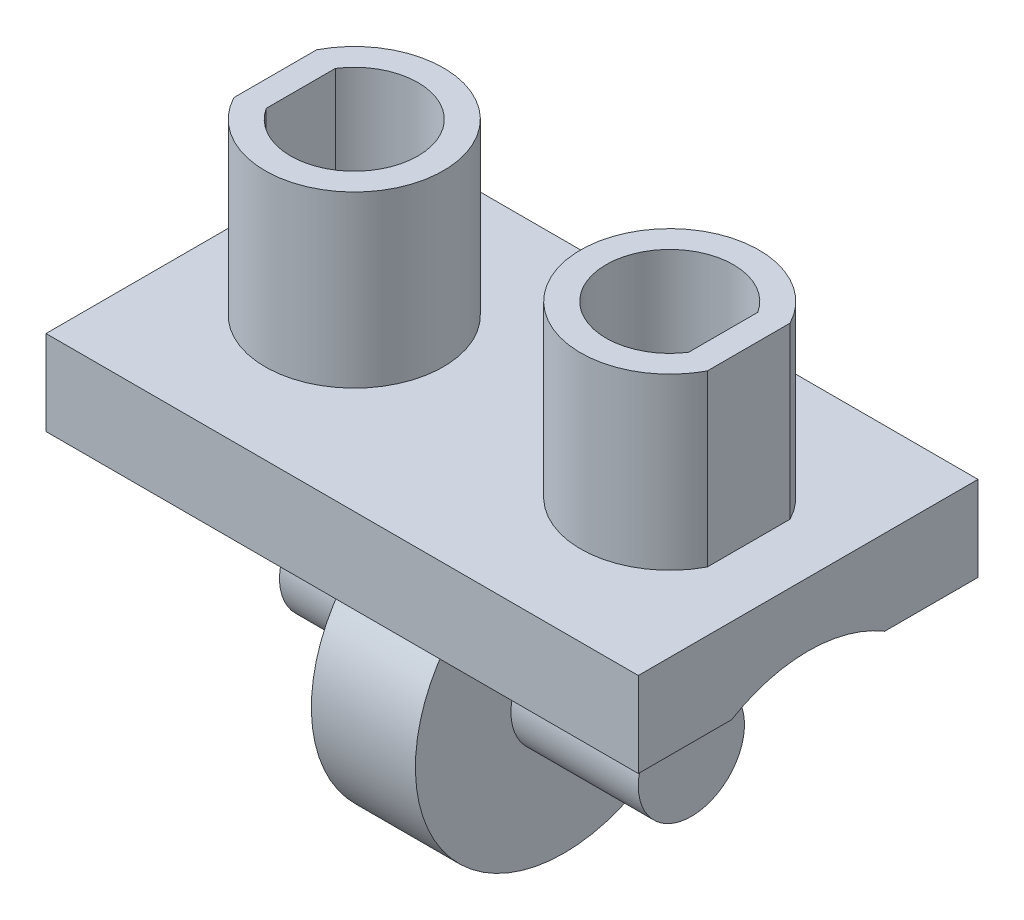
ISO-10303-21;
HEADER;
FILE_DESCRIPTION(('STEP AP214'),'2;1');
FILE_NAME('part.step','',(''),(''),'','','');
FILE_SCHEMA(('AUTOMOTIVE_DESIGN { 1 0 10303 214 1 1 1 1 }'));
ENDSEC;
DATA;
#1=APPLICATION_CONTEXT('core data for automotive mechanical design processes');
#2=APPLICATION_PROTOCOL_DEFINITION('international standard','automotive_design',2000,#1);
#3=PRODUCT_CONTEXT('',#1,'mechanical');
#4=PRODUCT('Part','Part','',(#3));
#5=PRODUCT_RELATED_PRODUCT_CATEGORY('part','',(#4));
#6=PRODUCT_DEFINITION_FORMATION('','',#4);
#7=PRODUCT_DEFINITION_CONTEXT('part definition',#1,'design');
#8=PRODUCT_DEFINITION('design','',#6,#7);
#9=PRODUCT_DEFINITION_SHAPE('','',#8);
#10=(LENGTH_UNIT() NAMED_UNIT(*) SI_UNIT(.MILLI.,.METRE.));
#11=(NAMED_UNIT(*) PLANE_ANGLE_UNIT() SI_UNIT($,.RADIAN.));
#12=(NAMED_UNIT(*) SI_UNIT($,.STERADIAN.) SOLID_ANGLE_UNIT());
#13=UNCERTAINTY_MEASURE_WITH_UNIT(LENGTH_MEASURE(1.E-05),#10,'distance_accuracy_value','');
#14=(GEOMETRIC_REPRESENTATION_CONTEXT(3) GLOBAL_UNCERTAINTY_ASSIGNED_CONTEXT((#13)) GLOBAL_UNIT_ASSIGNED_CONTEXT((#10,
#11,#12)) REPRESENTATION_CONTEXT('',''));
#15=CARTESIAN_POINT('',(0.,0.,0.));
#16=DIRECTION('',(0.,0.,1.));
#17=DIRECTION('',(1.,0.,0.));
#18=AXIS2_PLACEMENT_3D('',#15,#16,#17);
#19=CARTESIAN_POINT('',(10.975,16.,-4.5));
#20=DIRECTION('',(0.,1.,0.));
#21=DIRECTION('',(1.,0.,0.));
#22=AXIS2_PLACEMENT_3D('',#19,#20,#21);
#23=PLANE('',#22);
#24=CARTESIAN_POINT('',(7.71504933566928,16.,-0.5));
#25=DIRECTION('',(0.,1.,0.));
#26=DIRECTION('',(0.,0.,-1.));
#27=AXIS2_PLACEMENT_3D('',#24,#25,#26);
#28=CIRCLE('',#27,1.5);
#29=CARTESIAN_POINT('',(8.975,16.,-1.31395597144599));
#30=VERTEX_POINT('',#29);
#31=CARTESIAN_POINT('',(8.975,16.,0.313955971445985));
#32=VERTEX_POINT('',#31);
#33=EDGE_CURVE('E249',#30,#32,#28,.T.);
#34=ORIENTED_EDGE('',*,*,#33,.T.);
#35=DIRECTION('',(0.,0.,-1.));
#36=VECTOR('',#35,1.);
#37=CARTESIAN_POINT('',(8.975,16.,-1.31395597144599));
#38=LINE('',#37,#36);
#39=EDGE_CURVE('E11',#32,#30,#38,.T.);
#40=ORIENTED_EDGE('',*,*,#39,.T.);
#41=EDGE_LOOP('',(#34,#40));
#42=FACE_BOUND('',#41,.T.);
#43=ADVANCED_FACE('F17',(#42),#23,.T.);
#44=CARTESIAN_POINT('',(8.975,20.,-1.31395597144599));
#45=DIRECTION('',(-1.,0.,0.));
#46=DIRECTION('',(0.,0.,1.));
#47=AXIS2_PLACEMENT_3D('',#44,#45,#46);
#48=PLANE('',#47);
#49=ORIENTED_EDGE('',*,*,#39,.F.);
#50=DIRECTION('',(0.,-1.,0.));
#51=VECTOR('',#50,1.);
#52=CARTESIAN_POINT('',(8.975,20.,0.313955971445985));
#53=LINE('',#52,#51);
#54=CARTESIAN_POINT('',(8.975,20.,0.313955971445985));
#55=VERTEX_POINT('',#54);
#56=EDGE_CURVE('E254',#55,#32,#53,.T.);
#57=ORIENTED_EDGE('',*,*,#56,.F.);
#58=DIRECTION('',(0.,0.,-1.));
#59=VECTOR('',#58,1.);
#60=CARTESIAN_POINT('',(8.975,20.,-1.31395597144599));
#61=LINE('',#60,#59);
#62=CARTESIAN_POINT('',(8.975,20.,-1.31395597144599));
#63=VERTEX_POINT('',#62);
#64=EDGE_CURVE('E28',#55,#63,#61,.T.);
#65=ORIENTED_EDGE('',*,*,#64,.T.);
#66=DIRECTION('',(0.,-1.,0.));
#67=VECTOR('',#66,1.);
#68=CARTESIAN_POINT('',(8.975,20.,-1.31395597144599));
#69=LINE('',#68,#67);
#70=EDGE_CURVE('E253',#63,#30,#69,.T.);
#71=ORIENTED_EDGE('',*,*,#70,.T.);
#72=EDGE_LOOP('',(#49,#57,#65,#71));
#73=FACE_BOUND('',#72,.T.);
#74=ADVANCED_FACE('F455',(#73),#48,.T.);
#75=CARTESIAN_POINT('',(9.575,20.,-1.47497873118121));
#76=DIRECTION('',(-1.,0.,0.));
#77=DIRECTION('',(0.,1.,0.));
#78=AXIS2_PLACEMENT_3D('',#75,#76,#77);
#79=PLANE('',#78);
#80=DIRECTION('',(0.,0.,-1.));
#81=VECTOR('',#80,1.);
#82=CARTESIAN_POINT('',(9.575,16.,-1.47497873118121));
#83=LINE('',#82,#81);
#84=CARTESIAN_POINT('',(9.575,16.,0.4749787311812));
#85=VERTEX_POINT('',#84);
#86=CARTESIAN_POINT('',(9.575,16.,-1.47497873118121));
#87=VERTEX_POINT('',#86);
#88=EDGE_CURVE('E190',#85,#87,#83,.T.);
#89=ORIENTED_EDGE('',*,*,#88,.T.);
#90=DIRECTION('',(0.,-1.,0.));
#91=VECTOR('',#90,1.);
#92=CARTESIAN_POINT('',(9.575,20.,-1.47497873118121));
#93=LINE('',#92,#91);
#94=CARTESIAN_POINT('',(9.575,20.,-1.47497873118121));
#95=VERTEX_POINT('',#94);
#96=EDGE_CURVE('E350',#95,#87,#93,.T.);
#97=ORIENTED_EDGE('',*,*,#96,.F.);
#98=DIRECTION('',(0.,0.,-1.));
#99=VECTOR('',#98,1.);
#100=CARTESIAN_POINT('',(9.575,20.,-1.47497873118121));
#101=LINE('',#100,#99);
#102=CARTESIAN_POINT('',(9.575,20.,0.4749787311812));
#103=VERTEX_POINT('',#102);
#104=EDGE_CURVE('E338',#103,#95,#101,.T.);
#105=ORIENTED_EDGE('',*,*,#104,.F.);
#106=DIRECTION('',(0.,-1.,0.));
#107=VECTOR('',#106,1.);
#108=CARTESIAN_POINT('',(9.575,20.,0.4749787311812));
#109=LINE('',#108,#107);
#110=EDGE_CURVE('E225',#103,#85,#109,.T.);
#111=ORIENTED_EDGE('',*,*,#110,.T.);
#112=EDGE_LOOP('',(#89,#97,#105,#111));
#113=FACE_BOUND('',#112,.T.);
#114=ADVANCED_FACE('F461',(#113),#79,.F.);
#115=CARTESIAN_POINT('',(7.71504933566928,20.,-0.5));
#116=DIRECTION('',(0.,-1.,0.));
#117=DIRECTION('',(0.,0.,-1.));
#118=AXIS2_PLACEMENT_3D('',#115,#116,#117);
#119=PLANE('',#118);
#120=CARTESIAN_POINT('',(7.71504933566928,20.,-0.5));
#121=DIRECTION('',(0.,1.,0.));
#122=DIRECTION('',(0.,0.,-1.));
#123=AXIS2_PLACEMENT_3D('',#120,#121,#122);
#124=CIRCLE('',#123,1.5);
#125=EDGE_CURVE('E414',#63,#55,#124,.T.);
#126=ORIENTED_EDGE('',*,*,#125,.F.);
#127=ORIENTED_EDGE('',*,*,#64,.F.);
#128=EDGE_LOOP('',(#126,#127));
#129=FACE_BOUND('',#128,.T.);
#130=CARTESIAN_POINT('',(7.71504933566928,20.,-0.5));
#131=DIRECTION('',(0.,1.,0.));
#132=DIRECTION('',(0.,0.,-1.));
#133=AXIS2_PLACEMENT_3D('',#130,#131,#132);
#134=CIRCLE('',#133,2.1);
#135=EDGE_CURVE('E301',#95,#103,#134,.T.);
#136=ORIENTED_EDGE('',*,*,#135,.T.);
#137=ORIENTED_EDGE('',*,*,#104,.T.);
#138=EDGE_LOOP('',(#136,#137));
#139=FACE_BOUND('',#138,.T.);
#140=ADVANCED_FACE('F490',(#129,#139),#119,.F.);
#141=CARTESIAN_POINT('',(10.975,16.,-4.5));
#142=DIRECTION('',(0.,1.,0.));
#143=DIRECTION('',(1.,0.,0.));
#144=AXIS2_PLACEMENT_3D('',#141,#142,#143);
#145=PLANE('',#144);
#146=CARTESIAN_POINT('',(0.284950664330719,16.,-0.5));
#147=DIRECTION('',(0.,1.,0.));
#148=DIRECTION('',(0.,0.,1.));
#149=AXIS2_PLACEMENT_3D('',#146,#147,#148);
#150=CIRCLE('',#149,1.5);
#151=CARTESIAN_POINT('',(-0.975,16.,0.313955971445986));
#152=VERTEX_POINT('',#151);
#153=CARTESIAN_POINT('',(-0.975,16.,-1.31395597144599));
#154=VERTEX_POINT('',#153);
#155=EDGE_CURVE('E218',#152,#154,#150,.T.);
#156=ORIENTED_EDGE('',*,*,#155,.T.);
#157=DIRECTION('',(0.,0.,1.));
#158=VECTOR('',#157,1.);
#159=CARTESIAN_POINT('',(-0.975,16.,-1.31395597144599));
#160=LINE('',#159,#158);
#161=EDGE_CURVE('E211',#154,#152,#160,.T.);
#162=ORIENTED_EDGE('',*,*,#161,.T.);
#163=EDGE_LOOP('',(#156,#162));
#164=FACE_BOUND('',#163,.T.);
#165=ADVANCED_FACE('F471',(#164),#145,.T.);
#166=CARTESIAN_POINT('',(-0.975,20.,-1.31395597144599));
#167=DIRECTION('',(1.,0.,0.));
#168=DIRECTION('',(0.,1.,0.));
#169=AXIS2_PLACEMENT_3D('',#166,#167,#168);
#170=PLANE('',#169);
#171=ORIENTED_EDGE('',*,*,#161,.F.);
#172=DIRECTION('',(0.,-1.,0.));
#173=VECTOR('',#172,1.);
#174=CARTESIAN_POINT('',(-0.975,20.,-1.31395597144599));
#175=LINE('',#174,#173);
#176=CARTESIAN_POINT('',(-0.975,20.,-1.31395597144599));
#177=VERTEX_POINT('',#176);
#178=EDGE_CURVE('E206',#177,#154,#175,.T.);
#179=ORIENTED_EDGE('',*,*,#178,.F.);
#180=DIRECTION('',(0.,0.,1.));
#181=VECTOR('',#180,1.);
#182=CARTESIAN_POINT('',(-0.975,20.,-1.31395597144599));
#183=LINE('',#182,#181);
#184=CARTESIAN_POINT('',(-0.975,20.,0.313955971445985));
#185=VERTEX_POINT('',#184);
#186=EDGE_CURVE('E200',#177,#185,#183,.T.);
#187=ORIENTED_EDGE('',*,*,#186,.T.);
#188=DIRECTION('',(0.,-1.,0.));
#189=VECTOR('',#188,1.);
#190=CARTESIAN_POINT('',(-0.975,20.,0.313955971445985));
#191=LINE('',#190,#189);
#192=EDGE_CURVE('E203',#185,#152,#191,.T.);
#193=ORIENTED_EDGE('',*,*,#192,.T.);
#194=EDGE_LOOP('',(#171,#179,#187,#193));
#195=FACE_BOUND('',#194,.T.);
#196=ADVANCED_FACE('F202',(#195),#170,.T.);
#197=CARTESIAN_POINT('',(-1.575,20.,-1.4749787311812));
#198=DIRECTION('',(1.,0.,0.));
#199=DIRECTION('',(0.,1.,0.));
#200=AXIS2_PLACEMENT_3D('',#197,#198,#199);
#201=PLANE('',#200);
#202=DIRECTION('',(0.,0.,1.));
#203=VECTOR('',#202,1.);
#204=CARTESIAN_POINT('',(-1.575,16.,-1.4749787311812));
#205=LINE('',#204,#203);
#206=CARTESIAN_POINT('',(-1.575,16.,-1.4749787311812));
#207=VERTEX_POINT('',#206);
#208=CARTESIAN_POINT('',(-1.575,16.,0.474978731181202));
#209=VERTEX_POINT('',#208);
#210=EDGE_CURVE('E292',#207,#209,#205,.T.);
#211=ORIENTED_EDGE('',*,*,#210,.T.);
#212=DIRECTION('',(0.,-1.,0.));
#213=VECTOR('',#212,1.);
#214=CARTESIAN_POINT('',(-1.575,20.,0.474978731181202));
#215=LINE('',#214,#213);
#216=CARTESIAN_POINT('',(-1.575,20.,0.474978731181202));
#217=VERTEX_POINT('',#216);
#218=EDGE_CURVE('E305',#217,#209,#215,.T.);
#219=ORIENTED_EDGE('',*,*,#218,.F.);
#220=DIRECTION('',(0.,0.,1.));
#221=VECTOR('',#220,1.);
#222=CARTESIAN_POINT('',(-1.575,20.,-1.4749787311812));
#223=LINE('',#222,#221);
#224=CARTESIAN_POINT('',(-1.575,20.,-1.4749787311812));
#225=VERTEX_POINT('',#224);
#226=EDGE_CURVE('E212',#225,#217,#223,.T.);
#227=ORIENTED_EDGE('',*,*,#226,.F.);
#228=DIRECTION('',(0.,-1.,0.));
#229=VECTOR('',#228,1.);
#230=CARTESIAN_POINT('',(-1.575,20.,-1.4749787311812));
#231=LINE('',#230,#229);
#232=EDGE_CURVE('E318',#225,#207,#231,.T.);
#233=ORIENTED_EDGE('',*,*,#232,.T.);
#234=EDGE_LOOP('',(#211,#219,#227,#233));
#235=FACE_BOUND('',#234,.T.);
#236=ADVANCED_FACE('F380',(#235),#201,.F.);
#237=CARTESIAN_POINT('',(0.284950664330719,20.,-0.5));
#238=DIRECTION('',(0.,1.,0.));
#239=DIRECTION('',(1.,0.,0.));
#240=AXIS2_PLACEMENT_3D('',#237,#238,#239);
#241=PLANE('',#240);
#242=ORIENTED_EDGE('',*,*,#186,.F.);
#243=CARTESIAN_POINT('',(0.284950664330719,20.,-0.5));
#244=DIRECTION('',(0.,1.,0.));
#245=DIRECTION('',(0.,0.,1.));
#246=AXIS2_PLACEMENT_3D('',#243,#244,#245);
#247=CIRCLE('',#246,1.5);
#248=EDGE_CURVE('E216',#185,#177,#247,.T.);
#249=ORIENTED_EDGE('',*,*,#248,.F.);
#250=EDGE_LOOP('',(#242,#249));
#251=FACE_BOUND('',#250,.T.);
#252=CARTESIAN_POINT('',(0.284950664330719,20.,-0.5));
#253=DIRECTION('',(0.,1.,0.));
#254=DIRECTION('',(0.,0.,1.));
#255=AXIS2_PLACEMENT_3D('',#252,#253,#254);
#256=CIRCLE('',#255,2.1);
#257=EDGE_CURVE('E220',#217,#225,#256,.T.);
#258=ORIENTED_EDGE('',*,*,#257,.T.);
#259=ORIENTED_EDGE('',*,*,#226,.T.);
#260=EDGE_LOOP('',(#258,#259));
#261=FACE_BOUND('',#260,.T.);
#262=ADVANCED_FACE('F222',(#251,#261),#241,.T.);
#263=CARTESIAN_POINT('',(8.225,11.,-0.5));
#264=DIRECTION('',(1.,0.,0.));
#265=DIRECTION('',(0.,1.,0.));
#266=AXIS2_PLACEMENT_3D('',#263,#264,#265);
#267=PLANE('',#266);
#268=CARTESIAN_POINT('',(8.225,11.,-0.5));
#269=DIRECTION('',(1.,0.,0.));
#270=DIRECTION('',(0.,0.,-1.));
#271=AXIS2_PLACEMENT_3D('',#268,#269,#270);
#272=CIRCLE('',#271,1.25);
#273=CARTESIAN_POINT('',(8.225,11.,0.75));
#274=VERTEX_POINT('',#273);
#275=EDGE_CURVE('E312',#274,#274,#272,.T.);
#276=ORIENTED_EDGE('',*,*,#275,.T.);
#277=EDGE_LOOP('',(#276));
#278=FACE_BOUND('',#277,.T.);
#279=ADVANCED_FACE('F473',(#278),#267,.T.);
#280=CARTESIAN_POINT('',(-0.225,11.,-0.5));
#281=DIRECTION('',(-1.,0.,0.));
#282=DIRECTION('',(0.,0.,1.));
#283=AXIS2_PLACEMENT_3D('',#280,#281,#282);
#284=PLANE('',#283);
#285=CARTESIAN_POINT('',(-0.225,11.,-0.5));
#286=DIRECTION('',(-1.,0.,0.));
#287=DIRECTION('',(0.,0.,1.));
#288=AXIS2_PLACEMENT_3D('',#285,#286,#287);
#289=CIRCLE('',#288,1.25);
#290=CARTESIAN_POINT('',(-0.225,11.,-1.75));
#291=VERTEX_POINT('',#290);
#292=EDGE_CURVE('E266',#291,#291,#289,.T.);
#293=ORIENTED_EDGE('',*,*,#292,.T.);
#294=EDGE_LOOP('',(#293));
#295=FACE_BOUND('',#294,.T.);
#296=ADVANCED_FACE('F476',(#295),#284,.T.);
#297=CARTESIAN_POINT('',(5.225,11.,-0.5));
#298=DIRECTION('',(1.,0.,0.));
#299=DIRECTION('',(0.,0.,-1.));
#300=AXIS2_PLACEMENT_3D('',#297,#298,#299);
#301=CYLINDRICAL_SURFACE('',#300,3.5);
#302=DIRECTION('',(-1.,0.,0.));
#303=VECTOR('',#302,1.);
#304=CARTESIAN_POINT('',(10.975,14.,1.30277563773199));
#305=LINE('',#304,#303);
#306=CARTESIAN_POINT('',(10.975,14.,1.30277563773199));
#307=VERTEX_POINT('',#306);
#308=CARTESIAN_POINT('',(5.225,14.,1.30277563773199));
#309=VERTEX_POINT('',#308);
#310=EDGE_CURVE('E261',#307,#309,#305,.T.);
#311=ORIENTED_EDGE('',*,*,#310,.T.);
#312=CARTESIAN_POINT('',(5.225,11.,-0.5));
#313=DIRECTION('',(1.,0.,0.));
#314=DIRECTION('',(0.,0.,-1.));
#315=AXIS2_PLACEMENT_3D('',#312,#313,#314);
#316=CIRCLE('',#315,3.5);
#317=CARTESIAN_POINT('',(5.225,14.,-2.302775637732));
#318=VERTEX_POINT('',#317);
#319=EDGE_CURVE('E270',#318,#309,#316,.T.);
#320=ORIENTED_EDGE('',*,*,#319,.F.);
#321=DIRECTION('',(1.,0.,0.));
#322=VECTOR('',#321,1.);
#323=CARTESIAN_POINT('',(10.975,14.,-2.302775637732));
#324=LINE('',#323,#322);
#325=CARTESIAN_POINT('',(10.975,14.,-2.302775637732));
#326=VERTEX_POINT('',#325);
#327=EDGE_CURVE('E239',#318,#326,#324,.T.);
#328=ORIENTED_EDGE('',*,*,#327,.T.);
#329=CARTESIAN_POINT('',(10.975,11.,-0.5));
#330=DIRECTION('',(1.,0.,0.));
#331=DIRECTION('',(0.,0.,-1.));
#332=AXIS2_PLACEMENT_3D('',#329,#330,#331);
#333=CIRCLE('',#332,3.5);
#334=EDGE_CURVE('E313',#326,#307,#333,.T.);
#335=ORIENTED_EDGE('',*,*,#334,.T.);
#336=EDGE_LOOP('',(#311,#320,#328,#335));
#337=FACE_BOUND('',#336,.T.);
#338=ADVANCED_FACE('F440',(#337),#301,.F.);
#339=CARTESIAN_POINT('',(2.775,11.,-0.5));
#340=DIRECTION('',(-1.,0.,0.));
#341=DIRECTION('',(0.,0.,1.));
#342=AXIS2_PLACEMENT_3D('',#339,#340,#341);
#343=CYLINDRICAL_SURFACE('',#342,3.5);
#344=DIRECTION('',(-1.,0.,0.));
#345=VECTOR('',#344,1.);
#346=CARTESIAN_POINT('',(10.975,14.,1.30277563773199));
#347=LINE('',#346,#345);
#348=CARTESIAN_POINT('',(2.775,14.,1.30277563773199));
#349=VERTEX_POINT('',#348);
#350=CARTESIAN_POINT('',(-2.975,14.,1.30277563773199));
#351=VERTEX_POINT('',#350);
#352=EDGE_CURVE('E244',#349,#351,#347,.T.);
#353=ORIENTED_EDGE('',*,*,#352,.T.);
#354=CARTESIAN_POINT('',(-2.975,11.,-0.5));
#355=DIRECTION('',(-1.,0.,0.));
#356=DIRECTION('',(0.,0.,1.));
#357=AXIS2_PLACEMENT_3D('',#354,#355,#356);
#358=CIRCLE('',#357,3.5);
#359=CARTESIAN_POINT('',(-2.975,14.,-2.302775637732));
#360=VERTEX_POINT('',#359);
#361=EDGE_CURVE('E129',#351,#360,#358,.T.);
#362=ORIENTED_EDGE('',*,*,#361,.T.);
#363=DIRECTION('',(1.,0.,0.));
#364=VECTOR('',#363,1.);
#365=CARTESIAN_POINT('',(10.975,14.,-2.302775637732));
#366=LINE('',#365,#364);
#367=CARTESIAN_POINT('',(2.775,14.,-2.302775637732));
#368=VERTEX_POINT('',#367);
#369=EDGE_CURVE('E248',#360,#368,#366,.T.);
#370=ORIENTED_EDGE('',*,*,#369,.T.);
#371=CARTESIAN_POINT('',(2.775,11.,-0.5));
#372=DIRECTION('',(-1.,0.,0.));
#373=DIRECTION('',(0.,0.,1.));
#374=AXIS2_PLACEMENT_3D('',#371,#372,#373);
#375=CIRCLE('',#374,3.5);
#376=EDGE_CURVE('E274',#349,#368,#375,.T.);
#377=ORIENTED_EDGE('',*,*,#376,.F.);
#378=EDGE_LOOP('',(#353,#362,#370,#377));
#379=FACE_BOUND('',#378,.T.);
#380=ADVANCED_FACE('F19',(#379),#343,.F.);
#381=CARTESIAN_POINT('',(-2.975,14.,3.5));
#382=DIRECTION('',(0.,0.,1.));
#383=DIRECTION('',(1.,0.,0.));
#384=AXIS2_PLACEMENT_3D('',#381,#382,#383);
#385=PLANE('',#384);
#386=DIRECTION('',(0.,-1.,0.));
#387=VECTOR('',#386,1.);
#388=CARTESIAN_POINT('',(-2.975,16.,3.5));
#389=LINE('',#388,#387);
#390=CARTESIAN_POINT('',(-2.975,16.,3.5));
#391=VERTEX_POINT('',#390);
#392=CARTESIAN_POINT('',(-2.975,14.,3.5));
#393=VERTEX_POINT('',#392);
#394=EDGE_CURVE('E116',#391,#393,#389,.T.);
#395=ORIENTED_EDGE('',*,*,#394,.T.);
#396=DIRECTION('',(1.,0.,0.));
#397=VECTOR('',#396,1.);
#398=CARTESIAN_POINT('',(-2.975,14.,3.5));
#399=LINE('',#398,#397);
#400=CARTESIAN_POINT('',(10.975,14.,3.5));
#401=VERTEX_POINT('',#400);
#402=EDGE_CURVE('E245',#393,#401,#399,.T.);
#403=ORIENTED_EDGE('',*,*,#402,.T.);
#404=DIRECTION('',(0.,1.,0.));
#405=VECTOR('',#404,1.);
#406=CARTESIAN_POINT('',(10.975,14.,3.5));
#407=LINE('',#406,#405);
#408=CARTESIAN_POINT('',(10.975,16.,3.5));
#409=VERTEX_POINT('',#408);
#410=EDGE_CURVE('E349',#401,#409,#407,.T.);
#411=ORIENTED_EDGE('',*,*,#410,.T.);
#412=DIRECTION('',(-1.,0.,0.));
#413=VECTOR('',#412,1.);
#414=CARTESIAN_POINT('',(10.975,16.,3.5));
#415=LINE('',#414,#413);
#416=EDGE_CURVE('E21',#409,#391,#415,.T.);
#417=ORIENTED_EDGE('',*,*,#416,.T.);
#418=EDGE_LOOP('',(#395,#403,#411,#417));
#419=FACE_BOUND('',#418,.T.);
#420=ADVANCED_FACE('F423',(#419),#385,.T.);
#421=CARTESIAN_POINT('',(-2.975,14.,-4.5));
#422=DIRECTION('',(0.,0.,1.));
#423=DIRECTION('',(1.,0.,0.));
#424=AXIS2_PLACEMENT_3D('',#421,#422,#423);
#425=PLANE('',#424);
#426=DIRECTION('',(0.,-1.,0.));
#427=VECTOR('',#426,1.);
#428=CARTESIAN_POINT('',(-2.975,16.,-4.5));
#429=LINE('',#428,#427);
#430=CARTESIAN_POINT('',(-2.975,16.,-4.5));
#431=VERTEX_POINT('',#430);
#432=CARTESIAN_POINT('',(-2.975,14.,-4.5));
#433=VERTEX_POINT('',#432);
#434=EDGE_CURVE('E269',#431,#433,#429,.T.);
#435=ORIENTED_EDGE('',*,*,#434,.F.);
#436=DIRECTION('',(-1.,0.,0.));
#437=VECTOR('',#436,1.);
#438=CARTESIAN_POINT('',(10.975,16.,-4.5));
#439=LINE('',#438,#437);
#440=CARTESIAN_POINT('',(10.975,16.,-4.5));
#441=VERTEX_POINT('',#440);
#442=EDGE_CURVE('E357',#441,#431,#439,.T.);
#443=ORIENTED_EDGE('',*,*,#442,.F.);
#444=DIRECTION('',(0.,1.,0.));
#445=VECTOR('',#444,1.);
#446=CARTESIAN_POINT('',(10.975,14.,-4.5));
#447=LINE('',#446,#445);
#448=CARTESIAN_POINT('',(10.975,14.,-4.5));
#449=VERTEX_POINT('',#448);
#450=EDGE_CURVE('E368',#449,#441,#447,.T.);
#451=ORIENTED_EDGE('',*,*,#450,.F.);
#452=DIRECTION('',(1.,0.,0.));
#453=VECTOR('',#452,1.);
#454=CARTESIAN_POINT('',(-2.975,14.,-4.5));
#455=LINE('',#454,#453);
#456=EDGE_CURVE('E43',#433,#449,#455,.T.);
#457=ORIENTED_EDGE('',*,*,#456,.F.);
#458=EDGE_LOOP('',(#435,#443,#451,#457));
#459=FACE_BOUND('',#458,.T.);
#460=ADVANCED_FACE('F432',(#459),#425,.F.);
#461=CARTESIAN_POINT('',(-2.975,14.,-4.5));
#462=DIRECTION('',(0.,-1.,0.));
#463=DIRECTION('',(0.,0.,-1.));
#464=AXIS2_PLACEMENT_3D('',#461,#462,#463);
#465=PLANE('',#464);
#466=ORIENTED_EDGE('',*,*,#369,.F.);
#467=DIRECTION('',(0.,0.,1.));
#468=VECTOR('',#467,1.);
#469=CARTESIAN_POINT('',(-2.975,14.,-4.5));
#470=LINE('',#469,#468);
#471=EDGE_CURVE('E286',#433,#360,#470,.T.);
#472=ORIENTED_EDGE('',*,*,#471,.F.);
#473=ORIENTED_EDGE('',*,*,#456,.T.);
#474=DIRECTION('',(0.,0.,1.));
#475=VECTOR('',#474,1.);
#476=CARTESIAN_POINT('',(10.975,14.,-4.5));
#477=LINE('',#476,#475);
#478=EDGE_CURVE('E315',#449,#326,#477,.T.);
#479=ORIENTED_EDGE('',*,*,#478,.T.);
#480=ORIENTED_EDGE('',*,*,#327,.F.);
#481=DIRECTION('',(1.,0.,0.));
#482=VECTOR('',#481,1.);
#483=CARTESIAN_POINT('',(10.975,14.,-2.302775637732));
#484=LINE('',#483,#482);
#485=EDGE_CURVE('E291',#368,#318,#484,.T.);
#486=ORIENTED_EDGE('',*,*,#485,.F.);
#487=EDGE_LOOP('',(#466,#472,#473,#479,#480,#486));
#488=FACE_BOUND('',#487,.T.);
#489=ADVANCED_FACE('F442',(#488),#465,.T.);
#490=CARTESIAN_POINT('',(10.975,14.,-4.5));
#491=DIRECTION('',(1.,0.,0.));
#492=DIRECTION('',(0.,1.,0.));
#493=AXIS2_PLACEMENT_3D('',#490,#491,#492);
#494=PLANE('',#493);
#495=ORIENTED_EDGE('',*,*,#334,.F.);
#496=ORIENTED_EDGE('',*,*,#478,.F.);
#497=ORIENTED_EDGE('',*,*,#450,.T.);
#498=DIRECTION('',(0.,0.,1.));
#499=VECTOR('',#498,1.);
#500=CARTESIAN_POINT('',(10.975,16.,-4.5));
#501=LINE('',#500,#499);
#502=EDGE_CURVE('E354',#441,#409,#501,.T.);
#503=ORIENTED_EDGE('',*,*,#502,.T.);
#504=ORIENTED_EDGE('',*,*,#410,.F.);
#505=DIRECTION('',(0.,0.,1.));
#506=VECTOR('',#505,1.);
#507=CARTESIAN_POINT('',(10.975,14.,-4.5));
#508=LINE('',#507,#506);
#509=EDGE_CURVE('E257',#307,#401,#508,.T.);
#510=ORIENTED_EDGE('',*,*,#509,.F.);
#511=EDGE_LOOP('',(#495,#496,#497,#503,#504,#510));
#512=FACE_BOUND('',#511,.T.);
#513=ADVANCED_FACE('F428',(#512),#494,.T.);
#514=CARTESIAN_POINT('',(-2.975,16.,-4.5));
#515=DIRECTION('',(-1.,0.,0.));
#516=DIRECTION('',(0.,0.,1.));
#517=AXIS2_PLACEMENT_3D('',#514,#515,#516);
#518=PLANE('',#517);
#519=ORIENTED_EDGE('',*,*,#361,.F.);
#520=DIRECTION('',(0.,0.,1.));
#521=VECTOR('',#520,1.);
#522=CARTESIAN_POINT('',(-2.975,14.,-4.5));
#523=LINE('',#522,#521);
#524=EDGE_CURVE('E241',#351,#393,#523,.T.);
#525=ORIENTED_EDGE('',*,*,#524,.T.);
#526=ORIENTED_EDGE('',*,*,#394,.F.);
#527=DIRECTION('',(0.,0.,1.));
#528=VECTOR('',#527,1.);
#529=CARTESIAN_POINT('',(-2.975,16.,-4.5));
#530=LINE('',#529,#528);
#531=EDGE_CURVE('E295',#431,#391,#530,.T.);
#532=ORIENTED_EDGE('',*,*,#531,.F.);
#533=ORIENTED_EDGE('',*,*,#434,.T.);
#534=ORIENTED_EDGE('',*,*,#471,.T.);
#535=EDGE_LOOP('',(#519,#525,#526,#532,#533,#534));
#536=FACE_BOUND('',#535,.T.);
#537=ADVANCED_FACE('F433',(#536),#518,.T.);
#538=CARTESIAN_POINT('',(-2.975,14.,-4.5));
#539=DIRECTION('',(0.,-1.,0.));
#540=DIRECTION('',(0.,0.,-1.));
#541=AXIS2_PLACEMENT_3D('',#538,#539,#540);
#542=PLANE('',#541);
#543=ORIENTED_EDGE('',*,*,#310,.F.);
#544=ORIENTED_EDGE('',*,*,#509,.T.);
#545=ORIENTED_EDGE('',*,*,#402,.F.);
#546=ORIENTED_EDGE('',*,*,#524,.F.);
#547=ORIENTED_EDGE('',*,*,#352,.F.);
#548=DIRECTION('',(-1.,0.,0.));
#549=VECTOR('',#548,1.);
#550=CARTESIAN_POINT('',(10.975,14.,1.30277563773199));
#551=LINE('',#550,#549);
#552=EDGE_CURVE('E282',#309,#349,#551,.T.);
#553=ORIENTED_EDGE('',*,*,#552,.F.);
#554=EDGE_LOOP('',(#543,#544,#545,#546,#547,#553));
#555=FACE_BOUND('',#554,.T.);
#556=ADVANCED_FACE('F437',(#555),#542,.T.);
#557=CARTESIAN_POINT('',(2.775,11.,-0.5));
#558=DIRECTION('',(-1.,0.,0.));
#559=DIRECTION('',(0.,0.,1.));
#560=AXIS2_PLACEMENT_3D('',#557,#558,#559);
#561=PLANE('',#560);
#562=CARTESIAN_POINT('',(2.775,11.,-0.5));
#563=DIRECTION('',(-1.,0.,0.));
#564=DIRECTION('',(0.,0.,1.));
#565=AXIS2_PLACEMENT_3D('',#562,#563,#564);
#566=CIRCLE('',#565,1.25);
#567=CARTESIAN_POINT('',(2.775,11.,-1.75));
#568=VERTEX_POINT('',#567);
#569=EDGE_CURVE('E262',#568,#568,#566,.T.);
#570=ORIENTED_EDGE('',*,*,#569,.F.);
#571=EDGE_LOOP('',(#570));
#572=FACE_BOUND('',#571,.T.);
#573=ORIENTED_EDGE('',*,*,#376,.T.);
#574=CARTESIAN_POINT('',(2.775,11.,-0.5));
#575=DIRECTION('',(1.,0.,0.));
#576=DIRECTION('',(0.,0.,1.));
#577=AXIS2_PLACEMENT_3D('',#574,#575,#576);
#578=CIRCLE('',#577,3.5);
#579=EDGE_CURVE('E287',#349,#368,#578,.T.);
#580=ORIENTED_EDGE('',*,*,#579,.F.);
#581=EDGE_LOOP('',(#573,#580));
#582=FACE_BOUND('',#581,.T.);
#583=ADVANCED_FACE('F498',(#572,#582),#561,.T.);
#584=CARTESIAN_POINT('',(5.225,11.,-0.5));
#585=DIRECTION('',(1.,0.,0.));
#586=DIRECTION('',(0.,1.,0.));
#587=AXIS2_PLACEMENT_3D('',#584,#585,#586);
#588=PLANE('',#587);
#589=CARTESIAN_POINT('',(5.225,11.,-0.5));
#590=DIRECTION('',(1.,0.,0.));
#591=DIRECTION('',(0.,0.,-1.));
#592=AXIS2_PLACEMENT_3D('',#589,#590,#591);
#593=CIRCLE('',#592,1.25);
#594=CARTESIAN_POINT('',(5.225,11.,0.75));
#595=VERTEX_POINT('',#594);
#596=EDGE_CURVE('E278',#595,#595,#593,.T.);
#597=ORIENTED_EDGE('',*,*,#596,.F.);
#598=EDGE_LOOP('',(#597));
#599=FACE_BOUND('',#598,.T.);
#600=ORIENTED_EDGE('',*,*,#319,.T.);
#601=CARTESIAN_POINT('',(5.225,11.,-0.5));
#602=DIRECTION('',(1.,0.,0.));
#603=DIRECTION('',(0.,0.,-1.));
#604=AXIS2_PLACEMENT_3D('',#601,#602,#603);
#605=CIRCLE('',#604,3.5);
#606=EDGE_CURVE('E265',#309,#318,#605,.T.);
#607=ORIENTED_EDGE('',*,*,#606,.T.);
#608=EDGE_LOOP('',(#600,#607));
#609=FACE_BOUND('',#608,.T.);
#610=ADVANCED_FACE('F386',(#599,#609),#588,.T.);
#611=CARTESIAN_POINT('',(10.975,16.,-4.5));
#612=DIRECTION('',(0.,1.,0.));
#613=DIRECTION('',(1.,0.,0.));
#614=AXIS2_PLACEMENT_3D('',#611,#612,#613);
#615=PLANE('',#614);
#616=ORIENTED_EDGE('',*,*,#88,.F.);
#617=CARTESIAN_POINT('',(7.71504933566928,16.,-0.5));
#618=DIRECTION('',(0.,1.,0.));
#619=DIRECTION('',(0.,0.,-1.));
#620=AXIS2_PLACEMENT_3D('',#617,#618,#619);
#621=CIRCLE('',#620,2.1);
#622=EDGE_CURVE('E234',#87,#85,#621,.T.);
#623=ORIENTED_EDGE('',*,*,#622,.F.);
#624=EDGE_LOOP('',(#616,#623));
#625=FACE_BOUND('',#624,.T.);
#626=ORIENTED_EDGE('',*,*,#210,.F.);
#627=CARTESIAN_POINT('',(0.284950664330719,16.,-0.5));
#628=DIRECTION('',(0.,1.,0.));
#629=DIRECTION('',(0.,0.,1.));
#630=AXIS2_PLACEMENT_3D('',#627,#628,#629);
#631=CIRCLE('',#630,2.1);
#632=EDGE_CURVE('E309',#209,#207,#631,.T.);
#633=ORIENTED_EDGE('',*,*,#632,.F.);
#634=EDGE_LOOP('',(#626,#633));
#635=FACE_BOUND('',#634,.T.);
#636=ORIENTED_EDGE('',*,*,#416,.F.);
#637=ORIENTED_EDGE('',*,*,#502,.F.);
#638=ORIENTED_EDGE('',*,*,#442,.T.);
#639=ORIENTED_EDGE('',*,*,#531,.T.);
#640=EDGE_LOOP('',(#636,#637,#638,#639));
#641=FACE_BOUND('',#640,.T.);
#642=ADVANCED_FACE('F382',(#625,#635,#641),#615,.T.);
#643=CARTESIAN_POINT('',(10.975,11.,-0.5));
#644=DIRECTION('',(-1.,0.,0.));
#645=DIRECTION('',(0.,0.,1.));
#646=AXIS2_PLACEMENT_3D('',#643,#644,#645);
#647=CYLINDRICAL_SURFACE('',#646,3.5);
#648=ORIENTED_EDGE('',*,*,#606,.F.);
#649=ORIENTED_EDGE('',*,*,#552,.T.);
#650=ORIENTED_EDGE('',*,*,#579,.T.);
#651=ORIENTED_EDGE('',*,*,#485,.T.);
#652=EDGE_LOOP('',(#648,#649,#650,#651));
#653=FACE_BOUND('',#652,.T.);
#654=ADVANCED_FACE('F385',(#653),#647,.T.);
#655=CARTESIAN_POINT('',(-0.225,11.,-0.5));
#656=DIRECTION('',(1.,0.,0.));
#657=DIRECTION('',(0.,0.,-1.));
#658=AXIS2_PLACEMENT_3D('',#655,#656,#657);
#659=CYLINDRICAL_SURFACE('',#658,1.25);
#660=ORIENTED_EDGE('',*,*,#569,.T.);
#661=EDGE_LOOP('',(#660));
#662=FACE_BOUND('',#661,.T.);
#663=ORIENTED_EDGE('',*,*,#292,.F.);
#664=EDGE_LOOP('',(#663));
#665=FACE_BOUND('',#664,.T.);
#666=ADVANCED_FACE('F481',(#662,#665),#659,.T.);
#667=CARTESIAN_POINT('',(8.225,11.,-0.5));
#668=DIRECTION('',(-1.,0.,0.));
#669=DIRECTION('',(0.,0.,1.));
#670=AXIS2_PLACEMENT_3D('',#667,#668,#669);
#671=CYLINDRICAL_SURFACE('',#670,1.25);
#672=ORIENTED_EDGE('',*,*,#596,.T.);
#673=EDGE_LOOP('',(#672));
#674=FACE_BOUND('',#673,.T.);
#675=ORIENTED_EDGE('',*,*,#275,.F.);
#676=EDGE_LOOP('',(#675));
#677=FACE_BOUND('',#676,.T.);
#678=ADVANCED_FACE('F480',(#674,#677),#671,.T.);
#679=CARTESIAN_POINT('',(0.284950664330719,20.,-0.5));
#680=DIRECTION('',(0.,-1.,0.));
#681=DIRECTION('',(0.,0.,-1.));
#682=AXIS2_PLACEMENT_3D('',#679,#680,#681);
#683=CYLINDRICAL_SURFACE('',#682,2.1);
#684=ORIENTED_EDGE('',*,*,#257,.F.);
#685=ORIENTED_EDGE('',*,*,#218,.T.);
#686=ORIENTED_EDGE('',*,*,#632,.T.);
#687=ORIENTED_EDGE('',*,*,#232,.F.);
#688=EDGE_LOOP('',(#684,#685,#686,#687));
#689=FACE_BOUND('',#688,.T.);
#690=ADVANCED_FACE('F379',(#689),#683,.T.);
#691=CARTESIAN_POINT('',(0.284950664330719,20.,-0.5));
#692=DIRECTION('',(0.,-1.,0.));
#693=DIRECTION('',(0.,0.,-1.));
#694=AXIS2_PLACEMENT_3D('',#691,#692,#693);
#695=CYLINDRICAL_SURFACE('',#694,1.5);
#696=ORIENTED_EDGE('',*,*,#248,.T.);
#697=ORIENTED_EDGE('',*,*,#178,.T.);
#698=ORIENTED_EDGE('',*,*,#155,.F.);
#699=ORIENTED_EDGE('',*,*,#192,.F.);
#700=EDGE_LOOP('',(#696,#697,#698,#699));
#701=FACE_BOUND('',#700,.T.);
#702=ADVANCED_FACE('F215',(#701),#695,.F.);
#703=CARTESIAN_POINT('',(7.71504933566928,20.,-0.5));
#704=DIRECTION('',(0.,-1.,0.));
#705=DIRECTION('',(0.,0.,-1.));
#706=AXIS2_PLACEMENT_3D('',#703,#704,#705);
#707=CYLINDRICAL_SURFACE('',#706,2.1);
#708=ORIENTED_EDGE('',*,*,#135,.F.);
#709=ORIENTED_EDGE('',*,*,#96,.T.);
#710=ORIENTED_EDGE('',*,*,#622,.T.);
#711=ORIENTED_EDGE('',*,*,#110,.F.);
#712=EDGE_LOOP('',(#708,#709,#710,#711));
#713=FACE_BOUND('',#712,.T.);
#714=ADVANCED_FACE('F469',(#713),#707,.T.);
#715=CARTESIAN_POINT('',(7.71504933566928,20.,-0.5));
#716=DIRECTION('',(0.,-1.,0.));
#717=DIRECTION('',(0.,0.,-1.));
#718=AXIS2_PLACEMENT_3D('',#715,#716,#717);
#719=CYLINDRICAL_SURFACE('',#718,1.5);
#720=ORIENTED_EDGE('',*,*,#125,.T.);
#721=ORIENTED_EDGE('',*,*,#56,.T.);
#722=ORIENTED_EDGE('',*,*,#33,.F.);
#723=ORIENTED_EDGE('',*,*,#70,.F.);
#724=EDGE_LOOP('',(#720,#721,#722,#723));
#725=FACE_BOUND('',#724,.T.);
#726=ADVANCED_FACE('F492',(#725),#719,.F.);
#727=CLOSED_SHELL('',(#43,#74,#114,#140,#165,#196,#236,#262,#279,#296,#338,#380,#420,#460,#489,
#513,#537,#556,#583,#610,#642,#654,#666,#678,#690,#702,#714,#726));
#728=MANIFOLD_SOLID_BREP('B1',#727);
#729=ADVANCED_BREP_SHAPE_REPRESENTATION('',(#18,#728),#14);
#730=SHAPE_DEFINITION_REPRESENTATION(#9,#729);
ENDSEC;
END-ISO-10303-21;
